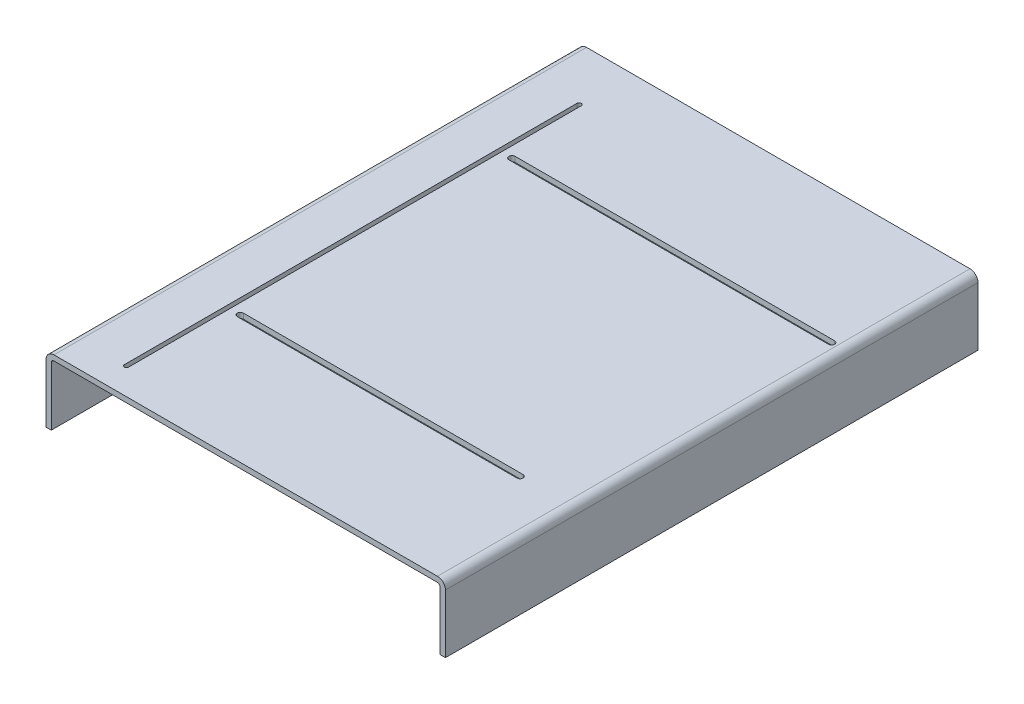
from build123d import *

# Parameters (mm, degrees)
AUFSATZ_LINEAR_AUSTRAGEN1_DEPTH = 1000
VERRUNDUNG1_R                   = 5
VERRUNDUNG2_R                   = 15
SCHNITT_LINEAR_AUSTRAGEN1_DEPTH = 10
SCHNITT_LINEAR_AUSTRAGEN2_DEPTH = 1257.23445264
SCHNITT_LINEAR_AUSTRAGEN4_REACH = 1258.234


with BuildPart() as part:
    # Skizze1 → Aufsatz-Linear austragen1 (new body)
    with BuildSketch(Plane.XY):
        Polygon((0, 0), (0, 125), (750, 125), (750, 0), (740, 0), (740, 115), (10, 115), (10, 0), align=None)
    extrude(amount=AUFSATZ_LINEAR_AUSTRAGEN1_DEPTH)

    # Verrundung1
    verrundung1_edges = [part.edges().sort_by_distance(p)[0] for p in [
        (740, 115, 500),
        (10, 115, 500),
    ]]
    fillet(verrundung1_edges, radius=VERRUNDUNG1_R)

    # Verrundung2
    verrundung2_edges = [part.edges().sort_by_distance(p)[0] for p in [
        (0, 125, 500),
        (750, 125, 500),
    ]]
    fillet(verrundung2_edges, radius=VERRUNDUNG2_R)

    # Skizze3 → Schnitt-Linear austragen1 (cut)
    with BuildSketch(Plane(origin=(0, 125, 0), x_dir=(1, 0, 0), z_dir=(0, 1, 0))):
        with BuildLine():
            Line((125, -255.75), (725, -255.75))
            ThreePointArc((725, -255.75), (730.75, -250), (725, -244.25))
            Line((725, -244.25), (125, -244.25))
            ThreePointArc((125, -244.25), (119.25, -250), (125, -255.75))
        make_face()
    extrude(amount=-SCHNITT_LINEAR_AUSTRAGEN1_DEPTH, mode=Mode.SUBTRACT)

    # Skizze4 → Schnitt-Linear austragen2 (cut, through all)
    with BuildSketch(Plane(origin=(0, 125, 0), x_dir=(1, 0, 0), z_dir=(0, 1, 0))):
        with BuildLine():
            Line((105, -100), (105, -950))
            ThreePointArc((105, -950), (101, -954), (97, -950))
            Line((97, -950), (97, -100))
            ThreePointArc((97, -100), (101, -96), (105, -100))
        make_face()
    extrude(amount=-SCHNITT_LINEAR_AUSTRAGEN2_DEPTH, mode=Mode.SUBTRACT)

    # Skizze8 → Schnitt-Linear austragen4 (cut, up to next)
    with BuildSketch(Plane(origin=(0, 125, 0), x_dir=(1, 0, 0), z_dir=(0, 1, 0)), mode=Mode.PRIVATE) as schnitt_linear_austragen4_sk1:
        with BuildLine():
            Line((125, -754.25), (650, -754.25))
            ThreePointArc((650, -754.25), (655.75, -760), (650, -765.75))
            Line((650, -765.75), (125, -765.75))
            ThreePointArc((125, -765.75), (119.25, -760), (125, -754.25))
        make_face()
    schnitt_linear_austragen4_tool1 = extrude(schnitt_linear_austragen4_sk1.sketch, amount=-SCHNITT_LINEAR_AUSTRAGEN4_REACH, mode=Mode.PRIVATE) & part.part
    add(schnitt_linear_austragen4_tool1.solids().sort_by_distance((387.5, 125, 760))[0], mode=Mode.SUBTRACT)


solid = part.part
